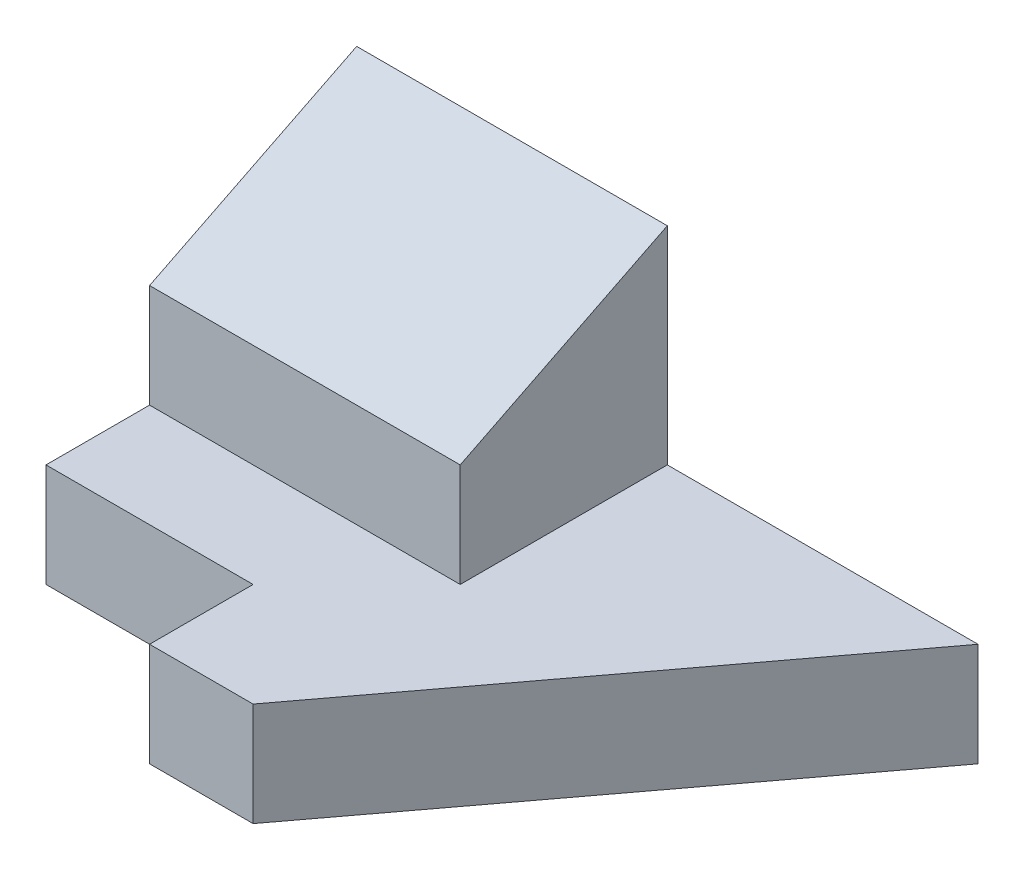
from build123d import *

# Parameters (mm, degrees)
EXTRUDE1_DEPTH = 10
EXTRUDE2_DEPTH = 30


with BuildPart() as part:
    # Sketch1 → Extrude1 (new body)
    with BuildSketch(Plane(origin=(0, 0, 0), x_dir=(1, 0, 0), z_dir=(0, 1, 0))):
        Polygon((0, 0), (20, 0), (20, -10), (30, -10), (60, 30), (0, 30), align=None)
    extrude(amount=EXTRUDE1_DEPTH)

    # Sketch2 → Extrude2 (add)
    with BuildSketch(Plane(origin=(0, 0, 0), x_dir=(0, 0, -1), z_dir=(1, 0, 0))):
        Polygon((30, 10), (30, 30), (10, 20), (10, 10), align=None)
    extrude(amount=EXTRUDE2_DEPTH)


solid = part.part
